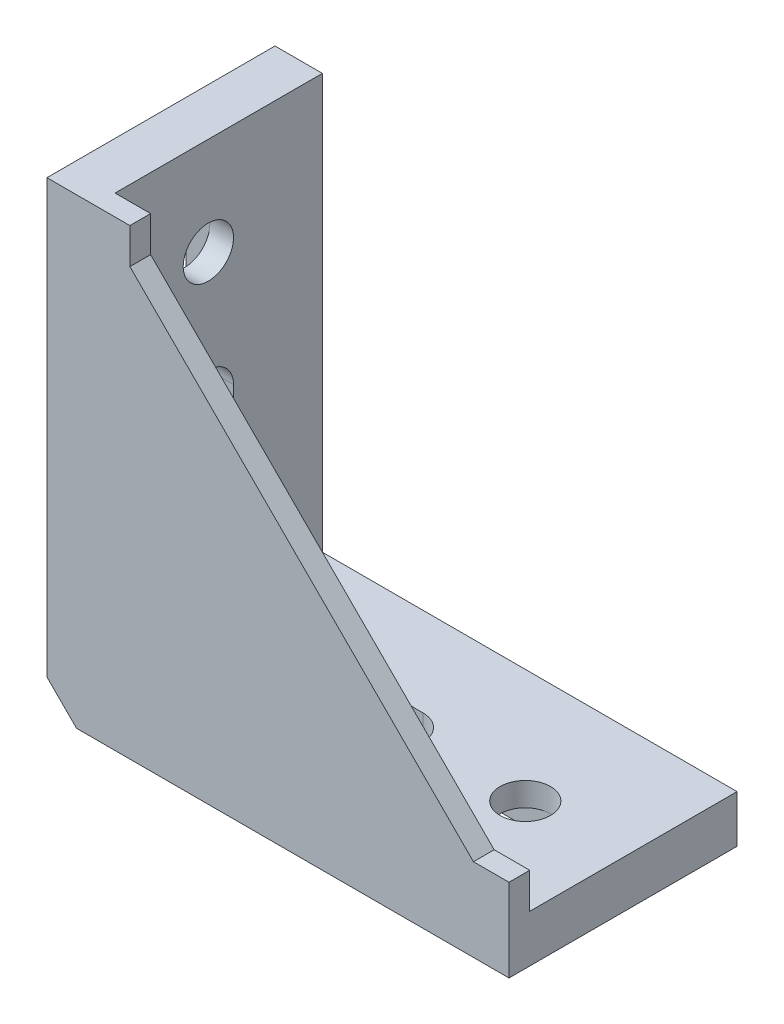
from build123d import *

# Parameters (mm, degrees)
EXTRUDE_1_DEPTH            = 38.5
EXTRUDE_2_DEPTH            = 3.5
SKETCH_3_R                 = 4.25
CUT_EXTRUDE_1_DEPTH        = 97.06105192
SKETCH_4_W                 = 8.5
SKETCH_4_H                 = 66.5
SKETCH_4_H_2               = 60
CUT_EXTRUDE_2_DEPTH        = 4
SKETCH_5_W                 = 7.8
SKETCH_5_H                 = 3.012530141
SKETCH_5_H_2               = 3.218031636
EXTRUDE_3_DEPTH            = 2
MIRROR_2_COPY_1_SKETCH_W   = 8.5
MIRROR_2_COPY_1_SKETCH_H   = 66.5
MIRROR_2_COPY_1_SKETCH_H_2 = 60
MIRROR_2_COPY_1_DEPTH      = 4
MIRROR_2_COPY_2_SKETCH_W   = 8.5
MIRROR_2_COPY_2_SKETCH_H   = 66.5
MIRROR_2_COPY_2_SKETCH_H_2 = 60
MIRROR_2_COPY_2_DEPTH      = 4
MIRROR_3_COPY_1_SKETCH_R   = 4.25
MIRROR_3_COPY_1_DEPTH      = 97.06105192
MIRROR_3_COPY_2_SKETCH_W   = 8.5
MIRROR_3_COPY_2_SKETCH_H   = 66.5
MIRROR_3_COPY_2_SKETCH_H_2 = 60
MIRROR_3_COPY_2_DEPTH      = 4
MIRROR_3_COPY_3_SKETCH_W   = 8.5
MIRROR_3_COPY_3_SKETCH_H   = 66.5
MIRROR_3_COPY_3_SKETCH_H_2 = 60
MIRROR_3_COPY_3_DEPTH      = 4
MIRROR_3_COPY_4_SKETCH_R   = 4.25
MIRROR_3_COPY_4_DEPTH      = 97.06105192
MIRROR_3_COPY_5_SKETCH_W   = 8.5
MIRROR_3_COPY_5_SKETCH_H   = 66.5
MIRROR_3_COPY_5_SKETCH_H_2 = 60
MIRROR_3_COPY_5_DEPTH      = 4
CHAMFER_1_SIZE             = 5


with BuildPart() as part:
    # Sketch 1 → Extrude 1 (new body)
    with BuildSketch(Plane.XY):
        Polygon((-40.506404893, 37.23879668), (-32.506404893, 37.23879668), (-32.506404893, -32.76120332), (37.493595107, -32.76120332), (37.493595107, -40.76120332), (-40.506404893, -40.76120332), align=None)
    extrude(amount=EXTRUDE_1_DEPTH)

    # Sketch 2 → Extrude 2 (add)
    with BuildSketch(Plane.XY.offset(38.5)):
        Polygon((-32.506404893, 37.23879668), (-26.506404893, 37.23879668), (-26.506404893, 31.23879668), (31.493595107, -26.76120332), (37.493595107, -26.76120332), (37.493595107, -32.76120332), (-32.506404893, -32.76120332), align=None)
    extrude(amount=-EXTRUDE_2_DEPTH)

    # Sketch 3 → Cut-Extrude 1 (cut, through all)
    with BuildSketch(Plane.ZY.offset(40.506404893)):
        with BuildLine():
            Line((19.25, -23.01120332), (19.25, 3.48879668))
            ThreePointArc((19.25, 3.48879668), (16.24479618, 2.244000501), (15, -0.76120332))
            Line((15, -0.76120332), (15, -18.76120332))
            ThreePointArc((15, -18.76120332), (16.24479618, -21.76640714), (19.25, -23.01120332))
        make_face()
        with BuildLine():
            ThreePointArc((23.5, -0.76120332), (22.25520382, 2.244000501), (19.25, 3.48879668))
            Line((19.25, 3.48879668), (19.25, -23.01120332))
            ThreePointArc((19.25, -23.01120332), (22.25520382, -21.76640714), (23.5, -18.76120332))
            Line((23.5, -18.76120332), (23.5, -0.76120332))
        make_face()
        with Locations((19.25, 20.73879668)):
            Circle(SKETCH_3_R)
    cut_extrude_1 = extrude(amount=-CUT_EXTRUDE_1_DEPTH, mode=Mode.SUBTRACT)

    # Sketch 4 → Cut-Extrude 2 (cut)
    with BuildSketch(Plane.ZY.offset(40.506404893)):
        with Locations((7.25, 0.48879668)):
            Rectangle(SKETCH_4_W, SKETCH_4_H)
        with Locations((30.75, 0.48879668)):
            Rectangle(SKETCH_4_W, SKETCH_4_H)
        with Locations((19.25, 0.23879668)):
            Rectangle(SKETCH_4_W, SKETCH_4_H_2)
    cut_extrude_2 = extrude(amount=-CUT_EXTRUDE_2_DEPTH, mode=Mode.SUBTRACT)

    # Sketch 5 → Extrude 3 (add)
    with BuildSketch(Plane.ZY.offset(40.506404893)):
        with Locations((19.25, 31.74506175)):
            Rectangle(SKETCH_5_W, SKETCH_5_H)
        with Locations((19.25, -31.370219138)):
            Rectangle(SKETCH_5_W, SKETCH_5_H_2)
    extrude_3 = extrude(amount=EXTRUDE_3_DEPTH)

    # Mirror 1: Cut-Extrude 2 across plane
    add(cut_extrude_2.mirror(Plane(origin=(0.127399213, -0.127399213, 0), x_dir=(0, 0, 1), z_dir=(0.7071067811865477, -0.7071067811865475, 0))), mode=Mode.SUBTRACT)

    # Mirror 2: Cut-Extrude 1 across plane
    add(cut_extrude_1.mirror(Plane(origin=(0.127399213, -0.127399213, 0), x_dir=(0, 0, 1), z_dir=(0.7071067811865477, -0.7071067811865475, 0))), mode=Mode.SUBTRACT)

    # Mirror 2 copy 1 sketch → Mirror 2 copy 1 (cut)
    with BuildSketch(Plane.ZY.offset(40.506404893)):
        with Locations((7.25, 0.48879668)):
            Rectangle(MIRROR_2_COPY_1_SKETCH_W, MIRROR_2_COPY_1_SKETCH_H)
        with Locations((30.75, 0.48879668)):
            Rectangle(MIRROR_2_COPY_1_SKETCH_W, MIRROR_2_COPY_1_SKETCH_H)
        with Locations((19.25, 0.23879668)):
            Rectangle(MIRROR_2_COPY_1_SKETCH_W, MIRROR_2_COPY_1_SKETCH_H_2)
    extrude(amount=-MIRROR_2_COPY_1_DEPTH, mode=Mode.SUBTRACT)

    # Mirror 2 copy 2 sketch → Mirror 2 copy 2 (cut)
    with BuildSketch(Plane(origin=(0.254798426, -40.76120332, 0), x_dir=(0, 0, 1), z_dir=(0, -1, 0))):
        with Locations((7.25, -0.48879668)):
            Rectangle(MIRROR_2_COPY_2_SKETCH_W, MIRROR_2_COPY_2_SKETCH_H)
        with Locations((30.75, -0.48879668)):
            Rectangle(MIRROR_2_COPY_2_SKETCH_W, MIRROR_2_COPY_2_SKETCH_H)
        with Locations((19.25, -0.23879668)):
            Rectangle(MIRROR_2_COPY_2_SKETCH_W, MIRROR_2_COPY_2_SKETCH_H_2)
    extrude(amount=-MIRROR_2_COPY_2_DEPTH, mode=Mode.SUBTRACT)

    # Mirror 3: Extrude 3 across plane
    add(extrude_3.mirror(Plane(origin=(0.127399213, -0.127399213, 0), x_dir=(0, 0, 1), z_dir=(0.7071067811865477, -0.7071067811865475, 0))))

    # Mirror 3 copy 1 sketch → Mirror 3 copy 1 (cut, through all)
    with BuildSketch(Plane.ZY.offset(40.506404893)):
        with BuildLine():
            Line((19.25, -23.01120332), (19.25, 3.48879668))
            ThreePointArc((19.25, 3.48879668), (16.24479618, 2.244000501), (15, -0.76120332))
            Line((15, -0.76120332), (15, -18.76120332))
            ThreePointArc((15, -18.76120332), (16.24479618, -21.76640714), (19.25, -23.01120332))
        make_face()
        with BuildLine():
            ThreePointArc((23.5, -0.76120332), (22.25520382, 2.244000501), (19.25, 3.48879668))
            Line((19.25, 3.48879668), (19.25, -23.01120332))
            ThreePointArc((19.25, -23.01120332), (22.25520382, -21.76640714), (23.5, -18.76120332))
            Line((23.5, -18.76120332), (23.5, -0.76120332))
        make_face()
        with Locations((19.25, 20.73879668)):
            Circle(MIRROR_3_COPY_1_SKETCH_R)
    extrude(amount=-MIRROR_3_COPY_1_DEPTH, mode=Mode.SUBTRACT)

    # Mirror 3 copy 2 sketch → Mirror 3 copy 2 (cut)
    with BuildSketch(Plane(origin=(0.254798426, -40.76120332, 0), x_dir=(0, 0, 1), z_dir=(0, -1, 0))):
        with Locations((7.25, -0.48879668)):
            Rectangle(MIRROR_3_COPY_2_SKETCH_W, MIRROR_3_COPY_2_SKETCH_H)
        with Locations((30.75, -0.48879668)):
            Rectangle(MIRROR_3_COPY_2_SKETCH_W, MIRROR_3_COPY_2_SKETCH_H)
        with Locations((19.25, -0.23879668)):
            Rectangle(MIRROR_3_COPY_2_SKETCH_W, MIRROR_3_COPY_2_SKETCH_H_2)
    extrude(amount=-MIRROR_3_COPY_2_DEPTH, mode=Mode.SUBTRACT)

    # Mirror 3 copy 3 sketch → Mirror 3 copy 3 (cut)
    with BuildSketch(Plane.ZY.offset(40.506404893)):
        with Locations((7.25, 0.48879668)):
            Rectangle(MIRROR_3_COPY_3_SKETCH_W, MIRROR_3_COPY_3_SKETCH_H)
        with Locations((30.75, 0.48879668)):
            Rectangle(MIRROR_3_COPY_3_SKETCH_W, MIRROR_3_COPY_3_SKETCH_H)
        with Locations((19.25, 0.23879668)):
            Rectangle(MIRROR_3_COPY_3_SKETCH_W, MIRROR_3_COPY_3_SKETCH_H_2)
    extrude(amount=-MIRROR_3_COPY_3_DEPTH, mode=Mode.SUBTRACT)

    # Mirror 3 copy 4 sketch → Mirror 3 copy 4 (cut, through all)
    with BuildSketch(Plane(origin=(0.254798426, -40.76120332, 0), x_dir=(0, 0, 1), z_dir=(0, -1, 0))):
        with BuildLine():
            Line((19.25, 23.01120332), (19.25, -3.48879668))
            ThreePointArc((19.25, -3.48879668), (16.24479618, -2.244000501), (15, 0.76120332))
            Line((15, 0.76120332), (15, 18.76120332))
            ThreePointArc((15, 18.76120332), (16.24479618, 21.76640714), (19.25, 23.01120332))
        make_face()
        with BuildLine():
            ThreePointArc((23.5, 0.76120332), (22.25520382, -2.244000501), (19.25, -3.48879668))
            Line((19.25, -3.48879668), (19.25, 23.01120332))
            ThreePointArc((19.25, 23.01120332), (22.25520382, 21.76640714), (23.5, 18.76120332))
            Line((23.5, 18.76120332), (23.5, 0.76120332))
        make_face()
        with Locations((19.25, -20.73879668)):
            Circle(MIRROR_3_COPY_4_SKETCH_R)
    extrude(amount=-MIRROR_3_COPY_4_DEPTH, mode=Mode.SUBTRACT)

    # Mirror 3 copy 5 sketch → Mirror 3 copy 5 (cut)
    with BuildSketch(Plane(origin=(0.254798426, -40.76120332, 0), x_dir=(0, 0, 1), z_dir=(0, -1, 0))):
        with Locations((7.25, -0.48879668)):
            Rectangle(MIRROR_3_COPY_5_SKETCH_W, MIRROR_3_COPY_5_SKETCH_H)
        with Locations((30.75, -0.48879668)):
            Rectangle(MIRROR_3_COPY_5_SKETCH_W, MIRROR_3_COPY_5_SKETCH_H)
        with Locations((19.25, -0.23879668)):
            Rectangle(MIRROR_3_COPY_5_SKETCH_W, MIRROR_3_COPY_5_SKETCH_H_2)
    extrude(amount=-MIRROR_3_COPY_5_DEPTH, mode=Mode.SUBTRACT)

    # Chamfer 1
    chamfer_1_edges = [part.edges().sort_by_distance(p)[0] for p in [
        (-40.506404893, -40.76120332, 19.25),
    ]]
    chamfer(chamfer_1_edges, length=CHAMFER_1_SIZE)


solid = part.part
